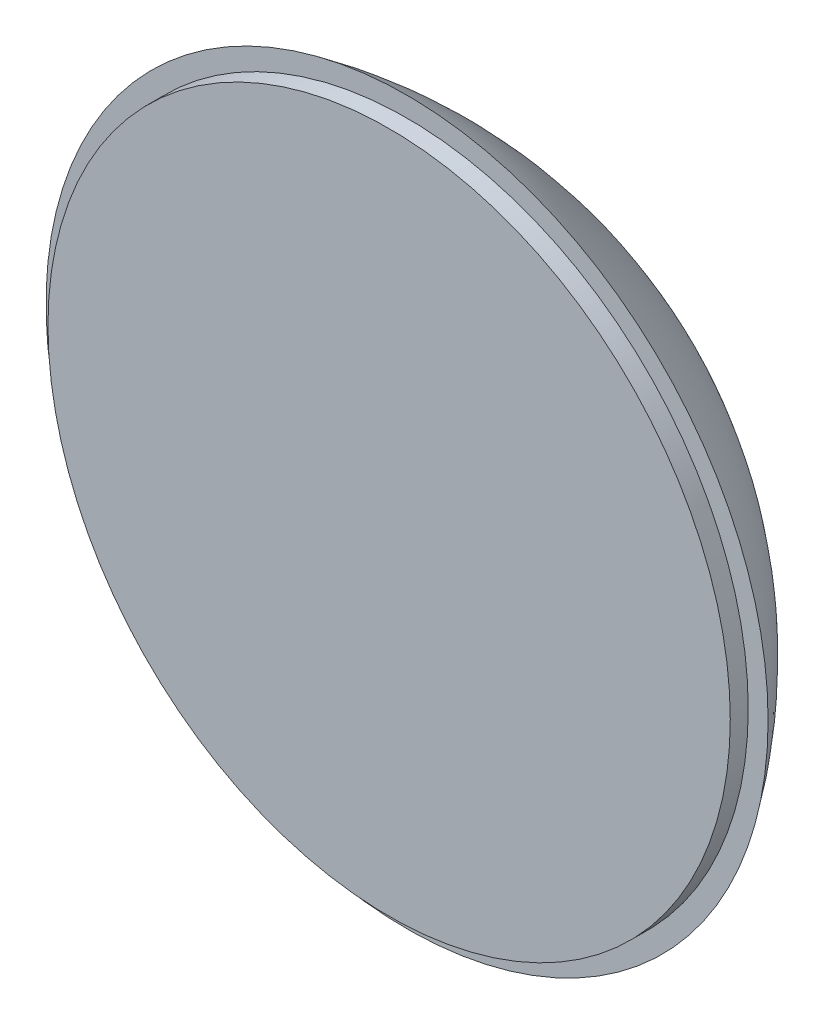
from build123d import *


with BuildPart() as part:
    # Sketch 1 → Revolve 2 (revolve)
    with BuildSketch(Plane(origin=(0, 0, 0), x_dir=(1, 0, 0), z_dir=(0, 1, 0))):
        with BuildLine():
            Line((0, 0), (38, 0))
            Line((38, 0), (38, 2))
            Line((38, 2), (40.211938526, 2))
            ThreePointArc((40.211938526, 2), (22.682592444, 17.433857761), (0, 23))
            Line((0, 23), (0, 0))
        make_face()
    revolve(axis=Axis((0, 0, 0), (0, 0, -1)))

    # Sweep 2: sweep along a path in Sketch 3
    with BuildLine(Plane(origin=(0, 0, 0), x_dir=(1, 0, 0), z_dir=(0, 1, 0))) as sweep_2_path:
        ThreePointArc((3, 19.6), (18.031723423, 15.990676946), (31, 7.576182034))
    # Sketch 2 → Sweep 2 (sweep, cut)
    with BuildSketch(Plane(origin=(3, 0, 0), x_dir=(0, 0, -1), z_dir=(1, 0, 0))):
        with BuildLine():
            Line((24.6, 5), (31.8, 5))
            Line((31.8, 5), (31.8, -5))
            Line((31.8, -5), (24.6, -5))
            ThreePointArc((24.6, -5), (19.6, 0), (24.6, 5))
        make_face()
    sweep_2 = sweep(path=sweep_2_path.line, mode=Mode.SUBTRACT)

    # Mirror 5: Sweep 2 across plane
    add(sweep_2.mirror(Plane(origin=(0, 0, 0), x_dir=(0, 0, 1), z_dir=(1, 0, 0))), mode=Mode.SUBTRACT)


solid = part.part
